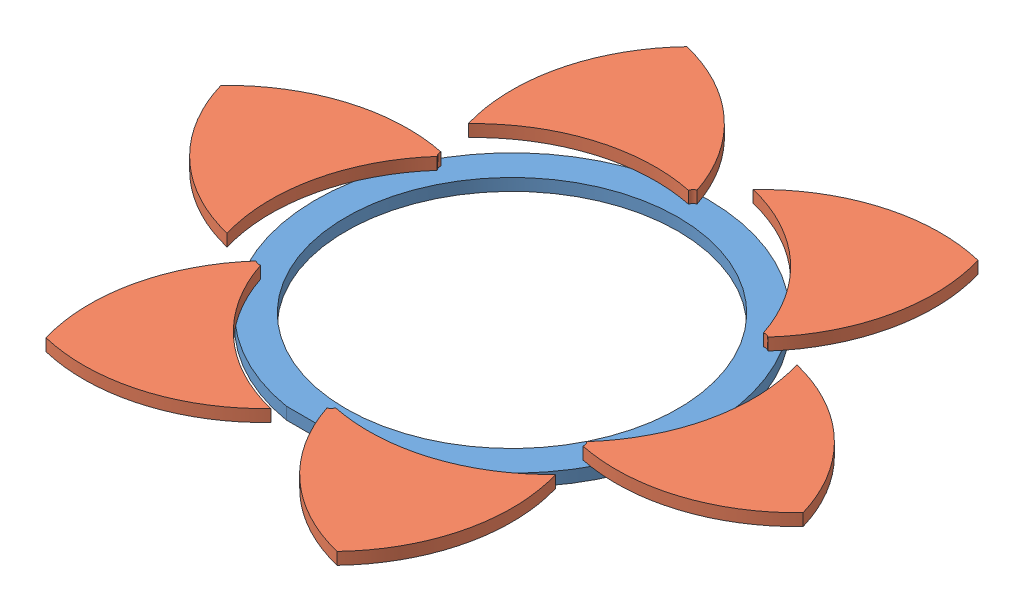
SolidWorks assembly iris2.sldasm, configuration Default (file format 10000). Lengths in mm.
Overall size (116.59 4 109.84).
7 component instances, 2 part files, 2 mates.
Components (placement in the parent):
- base-2-1: base-2.sldprt [Default] at origin size (65 2 64.56)
- leaf-2-1: leaf-2.sldprt [Default] at (28.7815 0 21.5369) x (0.282103 0 0.959384) z (-0.959384 0 0.282103) size (25.98 2 29.98)
- leaf-2-2: leaf-2.sldprt [Default] at (-4.2608 0 35.694) x (-0.6898 0 0.724) z (-0.724 0 -0.6898) size (25.98 2 29.98)
- leaf-2-3: leaf-2.sldprt [Default] at (-33.0423 0 14.1571) x (-0.971902 0 -0.235384) z (0.235384 0 -0.971902) size (25.98 2 29.98)
- leaf-2-4: leaf-2.sldprt [Default] at (-28.7815 0 -21.5369) x (-0.282103 0 -0.959384) z (0.959384 0 -0.282103) size (25.98 2 29.98)
- leaf-2-5: leaf-2.sldprt [Default] at (4.2608 0 -35.694) x (0.6898 0 -0.724) z (0.724 0 0.6898) size (25.98 2 29.98)
- leaf-2-6: leaf-2.sldprt [Default] at (33.0423 0 -14.1571) x (0.971902 0 0.235384) z (-0.235384 0 0.971902) size (25.98 2 29.98)
Mates (geometry in assembly coordinates):
- Concentric1: concentric: cylinder of base-2-1 through (0 1 30) axis (0 1 0) radius 1; cylinder of leaf-2-1 through (0 4 30) axis (0 -1 0) radius 1
- Coincident1: coincident anti-aligned: plane of leaf-2-1 through (28.7815 2 21.5369) normal (0 -1 0); plane of base-2-1 through (0 2 0) normal (0 1 0)
